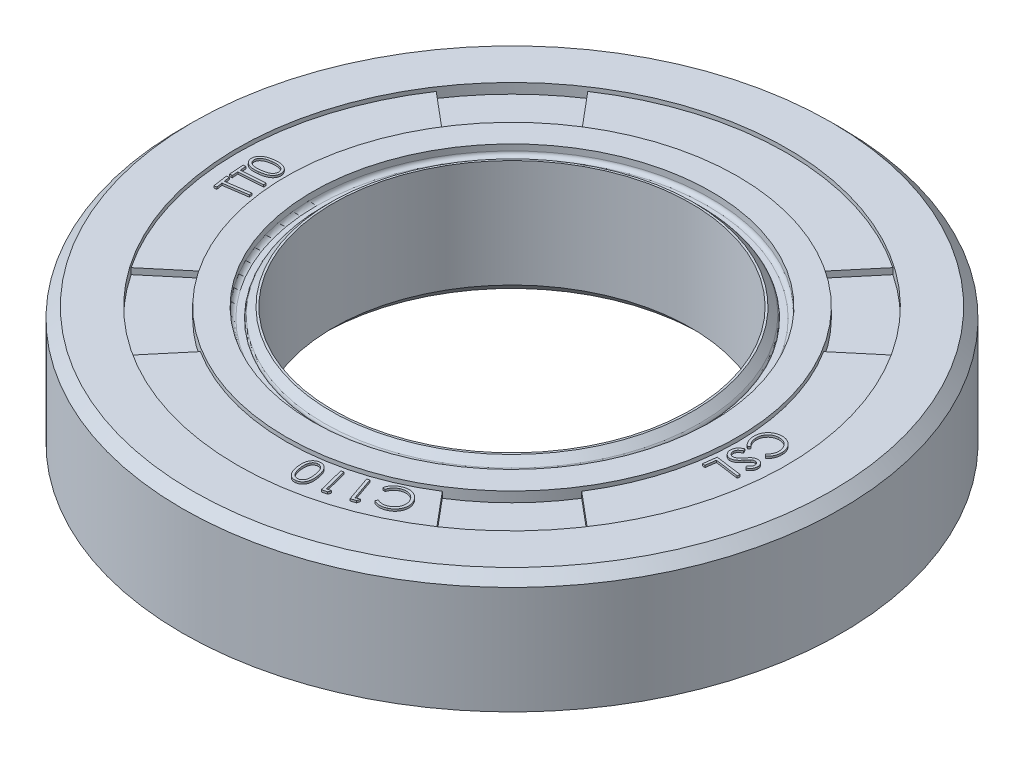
from build123d import *
from build123d.topology import SkipClean

# Parameters (mm, degrees)
SKETCH1_R         = 16.2
EXTRUDE1_DEPTH    = 5.8
SKETCH2_R         = 8.8
EXTRUDE2_DEPTH    = 24.633028
SKETCH3_R         = 15.1
SKETCH3_R_2       = 11.6
EXTRUDE3_DEPTH    = 4.3
EXTRUDE4_DEPTH    = 0.5
CIRPATTERN1_COUNT = 6
SKETCH5_R         = 13.5
SKETCH5_R_2       = 11.1
SKETCH5_R_3       = 9.8
SKETCH5_R_4       = 9.3
EXTRUDE5_DEPTH    = 0.5
CHAMFER1_SIZE     = 0.4
FILLET1_R         = 0.2
CHAMFER2_SIZE     = 0.5
CHAMFER3_SIZE     = 0.5
EXTRUDE6_START    = 0.3
EXTRUDE6_DEPTH    = 0.3
CIRPATTERN2_COUNT = 4
EXTRUDE11_DEPTH   = 0.1


with BuildPart() as part:
    # Sketch1 → Extrude1 (new body)
    with BuildSketch(Plane(origin=(0, 0, 0), x_dir=(1, 0, 0), z_dir=(0, 1, 0))):
        with Locations(Location((0, 0, 0), (0, 0, 270))):
            Circle(SKETCH1_R)
    extrude(amount=EXTRUDE1_DEPTH)

    # Sketch2 → Extrude2 (cut, through all)
    with BuildSketch(Plane(origin=(0, 5.8, 0), x_dir=(1, 0, 0), z_dir=(0, 1, 0))):
        with Locations(Location((0, 0, 0), (0, 0, 270))):
            Circle(SKETCH2_R)
    extrude(amount=-EXTRUDE2_DEPTH, mode=Mode.SUBTRACT)

    # Sketch3 → Extrude3 (cut)
    with BuildSketch(Plane.XZ):
        with Locations(Location((0, 0, 0), (0, 0, 270))):
            Circle(SKETCH3_R)
        with Locations(Location((0, 0, 0), (0, 0, 270))):
            Circle(SKETCH3_R_2, mode=Mode.SUBTRACT)
    extrude(amount=-EXTRUDE3_DEPTH, mode=Mode.SUBTRACT)

    # Sketch4 → Extrude4 (cut)
    with SkipClean():  # the faces are left unmerged after this step: merging them gives an invalid solid
        with BuildSketch(Plane.XZ.offset(-4.3)):
            with BuildLine():
                Line((-4, 14.560563), (-2.172243, 11.394795))
                ThreePointArc((-2.172243, 11.394795), (0, 11.6), (2.172243, 11.394795))
                Line((2.172243, 11.394795), (4, 14.560563))
                ThreePointArc((4, 14.560563), (0, 15.1), (-4, 14.560563))
            make_face()
        extrude4 = extrude(amount=-EXTRUDE4_DEPTH, mode=Mode.SUBTRACT)

    # CirPattern1: Extrude4 ×6 about axis
    with SkipClean():  # the faces are left unmerged after this step: merging them gives an invalid solid
        cirpattern1_axis = Axis((0, 0, 0), (0, 1, 0))
        for i in range(1, CIRPATTERN1_COUNT):
            add(extrude4.rotate(cirpattern1_axis, i * 360 / CIRPATTERN1_COUNT), mode=Mode.SUBTRACT)

    # Sketch5 → Extrude5 (cut)
    # profile 1 of 2: a face of its own
    with SkipClean():  # the faces are left unmerged after this step: merging them gives an invalid solid
        with BuildSketch(Plane(origin=(0, 5.8, 0), x_dir=(1, 0, 0), z_dir=(0, 1, 0))):
            with Locations(Location((0, 0, 0), (0, 0, 270))):
                Circle(SKETCH5_R)
            with Locations(Location((0, 0, 0), (0, 0, 270))):
                Circle(SKETCH5_R_2, mode=Mode.SUBTRACT)
        # profile 2 of 2: a face of its own
        with BuildSketch(Plane(origin=(0, 5.8, 0), x_dir=(1, 0, 0), z_dir=(0, 1, 0))):
            with Locations(Location((0, 0, 0), (0, 0, 270))):
                Circle(SKETCH5_R_3)
            with Locations(Location((0, 0, 0), (0, 0, 270))):
                Circle(SKETCH5_R_4, mode=Mode.SUBTRACT)
        extrude(amount=-EXTRUDE5_DEPTH, mode=Mode.SUBTRACT)

    # Chamfer1
    chamfer1_edges = [part.edges().sort_by_distance(p)[0] for p in [
        (0, 5.8, -9.3),
    ]]
    chamfer(chamfer1_edges, length=CHAMFER1_SIZE)

    # Fillet1
    fillet1_edges = [part.edges().sort_by_distance(p)[0] for p in [
        (0, 5.4, -9.3),
        (0, 5.3, -9.8),
    ]]
    fillet(fillet1_edges, radius=FILLET1_R)

    # Chamfer2
    chamfer2_edges = [part.edges().sort_by_distance(p)[0] for p in [
        (0, 5.8, -16.2),
    ]]
    chamfer(chamfer2_edges, length=CHAMFER2_SIZE)

    # Chamfer3
    chamfer3_edges = [part.edges().sort_by_distance(p)[0] for p in [
        (0, 0, -8.8),
    ]]
    chamfer(chamfer3_edges, length=CHAMFER3_SIZE)

    # Sketch6 → Extrude6 (add)
    with SkipClean():  # the faces are left unmerged after this step: merging them gives an invalid solid
        with BuildSketch(Plane(origin=(0, 5.3, 0), x_dir=(1, 0, 0), z_dir=(0, 1, 0)).offset(EXTRUDE6_START)):
            with BuildLine():
                Line((-7.5, 11.224972), (-5.946064, 9.373064))
                ThreePointArc((-5.946064, 9.373064), (0, 11.1), (5.946064, 9.373064))
                Line((5.946064, 9.373064), (7.5, 11.224972))
                ThreePointArc((7.5, 11.224972), (0, 13.5), (-7.5, 11.224972))
            make_face()
        extrude6 = extrude(amount=-EXTRUDE6_DEPTH)

    # CirPattern2: Extrude6 ×4 about axis
    with SkipClean():  # the faces are left unmerged after this step: merging them gives an invalid solid
        cirpattern2_axis = Axis((0, 0, 0), (0, 1, 0))
        for i in range(1, CIRPATTERN2_COUNT):
            add(extrude6.rotate(cirpattern2_axis, i * 360 / CIRPATTERN2_COUNT))

    # Sketch7 → Extrude11 (add)
    # profile 1 of 10: a face of its own
    with SkipClean():  # the faces are left unmerged after this step: merging them gives an invalid solid
        with BuildSketch(Plane(origin=(0, 5.6, 0), x_dir=(-1, 0, 0), z_dir=(0, 1, 0))):
            with BuildLine():
                Line((-12.492978, 0.035112), (-12.408441, -0.064795))
                add(Edge.make_bspline(
                    [(-12.408441, -0.064795), (-12.417189, -0.072471), (-12.434579, -0.087728), (-12.458825, -0.112145), (-12.481616, -0.137347), (-12.50214, -0.163939), (-12.521254, -0.191257), (-12.538963, -0.219412), (-12.554454, -0.248809), (-12.568315, -0.27905), (-12.580159, -0.310177), (-12.590613, -0.341854), (-12.598805, -0.374376), (-12.605071, -0.407495), (-12.609928, -0.441259), (-12.612883, -0.475675), (-12.61359, -0.510808), (-12.612864, -0.53439), (-12.612496, -0.546314)],
                    knots=[0, 0, 0, 0, 1.02892, 2.045308, 3.041134, 4.031861, 5.013584, 5.98904, 6.971043, 7.949872, 8.929137, 9.91483, 10.898169, 11.892492, 12.894519, 13.913695, 14.945133, 16, 16, 16, 16], degree=3))
                add(Edge.make_bspline(
                    [(-12.612496, -0.546314), (-12.611585, -0.559313), (-12.609776, -0.585126), (-12.604463, -0.623293), (-12.596763, -0.660564), (-12.58661, -0.697018), (-12.574249, -0.73274), (-12.559319, -0.767471), (-12.542246, -0.801373), (-12.523045, -0.834208), (-12.501937, -0.865827), (-12.47875, -0.895282), (-12.454753, -0.923457), (-12.428683, -0.949032), (-12.401169, -0.972864), (-12.372172, -0.99466), (-12.341785, -1.014841), (-12.309764, -1.0324), (-12.276579, -1.048064), (-12.242491, -1.061692), (-12.207244, -1.072467), (-12.171336, -1.081244), (-12.134507, -1.087653), (-12.096882, -1.091561), (-12.058284, -1.093263), (-12.032306, -1.092401), (-12.019145, -1.091964)],
                    knots=[0, 0, 0, 0, 1.043165, 2.07143, 3.082648, 4.08821, 5.099255, 6.106904, 7.112765, 8.136593, 9.150775, 10.153847, 11.136589, 12.111846, 13.074635, 14.049276, 15.014427, 15.99268, 16.970318, 17.951431, 18.929044, 19.918862, 20.909564, 21.919495, 22.945934, 24, 24, 24, 24], degree=3))
                add(Edge.make_bspline(
                    [(-12.019145, -1.091964), (-11.999493, -1.090465), (-11.960932, -1.087523), (-11.90461, -1.077094), (-11.851074, -1.061428), (-11.800273, -1.040586), (-11.751907, -1.015215), (-11.706797, -0.984072), (-11.664008, -0.948508), (-11.624942, -0.907689), (-11.589275, -0.863631), (-11.558607, -0.816484), (-11.533322, -0.766877), (-11.513061, -0.714863), (-11.497879, -0.660363), (-11.488265, -0.603353), (-11.483197, -0.543925), (-11.484318, -0.503566), (-11.48489, -0.482977)],
                    knots=[0, 0, 0, 0, 1.043704, 2.048011, 3.028478, 3.99412, 4.953069, 5.916338, 6.893156, 7.896099, 8.904836, 9.892782, 10.870329, 11.849891, 12.845787, 13.862269, 14.90941, 16, 16, 16, 16], degree=3))
                add(Edge.make_bspline(
                    [(-11.48489, -0.482977), (-11.486562, -0.46038), (-11.489847, -0.415973), (-11.503934, -0.351365), (-11.523661, -0.289784), (-11.550325, -0.231277), (-11.584032, -0.176227), (-11.624163, -0.124166), (-11.670792, -0.075154), (-11.706198, -0.046147), (-11.724192, -0.031404)],
                    knots=[0, 0, 0, 0, 1.028352, 2.020955, 2.995717, 3.961973, 4.934576, 5.921973, 6.943898, 8, 8, 8, 8], degree=3))
                Line((-11.724192, -0.031404), (-11.65052, 0.076454))
                add(Edge.make_bspline(
                    [(-11.65052, 0.076454), (-11.639908, 0.06863), (-11.618751, 0.053031), (-11.588857, 0.027423), (-11.56031, 0.000483), (-11.533993, -0.028571), (-11.508794, -0.058739), (-11.485944, -0.090931), (-11.464252, -0.12442), (-11.444531, -0.159601), (-11.426413, -0.196032), (-11.410841, -0.233932), (-11.397017, -0.272814), (-11.385326, -0.312983), (-11.375822, -0.354311), (-11.368408, -0.396859), (-11.363033, -0.440555), (-11.361241, -0.470155), (-11.360337, -0.485097)],
                    knots=[0, 0, 0, 0, 0.965909, 1.925811, 2.882828, 3.840457, 4.797013, 5.761815, 6.731535, 7.720025, 8.715991, 9.711473, 10.720919, 11.739129, 12.775595, 13.827155, 14.903162, 16, 16, 16, 16], degree=3))
                add(Edge.make_bspline(
                    [(-11.360337, -0.485097), (-11.35973, -0.499317), (-11.358531, -0.527401), (-11.359621, -0.569044), (-11.361711, -0.609664), (-11.366462, -0.649152), (-11.372293, -0.687702), (-11.380746, -0.725033), (-11.390321, -0.76151), (-11.40247, -0.796685), (-11.415806, -0.831076), (-11.431615, -0.864113), (-11.448804, -0.896299), (-11.467875, -0.927459), (-11.489292, -0.957281), (-11.511888, -0.98662), (-11.536921, -1.014374), (-11.55468, -1.031978), (-11.563597, -1.040817)],
                    knots=[0, 0, 0, 0, 1.116828, 2.205582, 3.268238, 4.308028, 5.325951, 6.32692, 7.310839, 8.284344, 9.246125, 10.204501, 11.156839, 12.109353, 13.069307, 14.037415, 15.014544, 16, 16, 16, 16], degree=3))
                add(Edge.make_bspline(
                    [(-11.563597, -1.040817), (-11.579236, -1.055002), (-11.610305, -1.083181), (-11.661343, -1.119694), (-11.714926, -1.151422), (-11.771442, -1.177685), (-11.830584, -1.199035), (-11.892518, -1.215054), (-11.957202, -1.226537), (-12.001432, -1.229557), (-12.023915, -1.231093)],
                    knots=[0, 0, 0, 0, 0.994537, 1.9757, 2.951903, 3.92615, 4.908717, 5.911596, 6.938418, 8, 8, 8, 8], degree=3))
                add(Edge.make_bspline(
                    [(-12.023915, -1.231093), (-12.047597, -1.231637), (-12.094169, -1.232707), (-12.162917, -1.226468), (-12.22903, -1.213675), (-12.292714, -1.194656), (-12.353729, -1.168655), (-12.412265, -1.136472), (-12.468227, -1.09779), (-12.520834, -1.052922), (-12.569214, -1.00319), (-12.612583, -0.949738), (-12.649607, -0.892424), (-12.680387, -0.831531), (-12.705119, -0.767217), (-12.723987, -0.699538), (-12.736833, -0.628268), (-12.740489, -0.5794), (-12.74235, -0.554529)],
                    knots=[0, 0, 0, 0, 1.031303, 2.028055, 3.000099, 3.960627, 4.917641, 5.883826, 6.86585, 7.875936, 8.890971, 9.88439, 10.869584, 11.857412, 12.851463, 13.866353, 14.91406, 16, 16, 16, 16], degree=3))
                add(Edge.make_bspline(
                    [(-12.74235, -0.554529), (-12.742883, -0.539336), (-12.743938, -0.5093), (-12.742366, -0.464638), (-12.739227, -0.420979), (-12.732863, -0.378388), (-12.724839, -0.336748), (-12.714082, -0.296193), (-12.701535, -0.256506), (-12.685967, -0.218137), (-12.668675, -0.180908), (-12.649133, -0.145247), (-12.628079, -0.111063), (-12.604822, -0.078533), (-12.57976, -0.047657), (-12.552748, -0.018302), (-12.524056, 0.009593), (-12.503349, 0.026597), (-12.492978, 0.035112)],
                    knots=[0, 0, 0, 0, 1.096133, 2.166959, 3.221456, 4.251317, 5.2709, 6.278447, 7.275791, 8.270771, 9.262646, 10.234846, 11.201939, 12.156612, 13.116817, 14.068253, 15.032509, 16, 16, 16, 16], degree=3))
            make_face()
        # profile 2 of 10: a face of its own
        with BuildSketch(Plane(origin=(0, 5.6, 0), x_dir=(-1, 0, 0), z_dir=(0, 1, 0))):
            with BuildLine():
                Line((-11.669875, 0.228166), (-11.730562, 0.34371))
                add(Edge.make_bspline(
                    [(-11.730562, 0.34371), (-11.712834, 0.352528), (-11.678971, 0.369371), (-11.632686, 0.39797), (-11.593482, 0.428634), (-11.560508, 0.460322), (-11.534108, 0.493755), (-11.515183, 0.529145), (-11.502279, 0.566024), (-11.499526, 0.591482), (-11.49815, 0.604212)],
                    knots=[0, 0, 0, 0, 1.295561, 2.474722, 3.553828, 4.547373, 5.462176, 6.328771, 7.164335, 8, 8, 8, 8], degree=3))
                add(Edge.make_bspline(
                    [(-11.49815, 0.604212), (-11.497858, 0.615176), (-11.497281, 0.636834), (-11.501538, 0.669066), (-11.509395, 0.70044), (-11.521464, 0.730475), (-11.536223, 0.758703), (-11.55438, 0.783921), (-11.575571, 0.805574), (-11.599183, 0.823828), (-11.624658, 0.838734), (-11.651474, 0.8499), (-11.679406, 0.857312), (-11.698454, 0.859063), (-11.708036, 0.859944)],
                    knots=[0, 0, 0, 0, 1.071265, 2.116041, 3.167901, 4.226727, 5.274107, 6.276407, 7.253901, 8.226803, 9.186963, 10.131962, 11.060228, 12, 12, 12, 12], degree=3))
                add(Edge.make_bspline(
                    [(-11.708036, 0.859944), (-11.719116, 0.860106), (-11.741405, 0.860432), (-11.774762, 0.853008), (-11.808357, 0.841313), (-11.829406, 0.829132), (-11.840275, 0.822843)],
                    knots=[0, 0, 0, 0, 0.950468, 1.912027, 2.921918, 4, 4, 4, 4], degree=3))
                add(Edge.make_bspline(
                    [(-11.840275, 0.822843), (-11.848098, 0.817614), (-11.864575, 0.806603), (-11.88944, 0.787787), (-11.915409, 0.765623), (-11.942679, 0.740383), (-11.971306, 0.712082), (-12.000839, 0.680309), (-12.032261, 0.646049), (-12.052983, 0.621599), (-12.063676, 0.608982)],
                    knots=[0, 0, 0, 0, 0.727589, 1.532321, 2.409631, 3.366842, 4.405402, 5.52175, 6.721105, 8, 8, 8, 8], degree=3))
                add(Edge.make_bspline(
                    [(-12.063676, 0.608982), (-12.074399, 0.596391), (-12.094857, 0.572366), (-12.124923, 0.5388), (-12.152156, 0.508626), (-12.177319, 0.482445), (-12.200071, 0.459859), (-12.22037, 0.440987), (-12.238339, 0.425902), (-12.25001, 0.417839), (-12.255276, 0.414202)],
                    knots=[0, 0, 0, 0, 1.449171, 2.765067, 3.948631, 5.010734, 5.946735, 6.757493, 7.43939, 8, 8, 8, 8], degree=3))
                add(Edge.make_bspline(
                    [(-12.255276, 0.414202), (-12.263321, 0.409026), (-12.279145, 0.398846), (-12.304046, 0.386155), (-12.329142, 0.375423), (-12.354772, 0.367358), (-12.380548, 0.360724), (-12.406837, 0.356942), (-12.433423, 0.354842), (-12.451203, 0.355546), (-12.460127, 0.3559)],
                    knots=[0, 0, 0, 0, 1.058242, 2.081577, 3.089472, 4.07589, 5.052959, 6.032031, 7.012226, 8, 8, 8, 8], degree=3))
                add(Edge.make_bspline(
                    [(-12.460127, 0.3559), (-12.474137, 0.357222), (-12.501663, 0.35982), (-12.541746, 0.369831), (-12.579447, 0.385069), (-12.614928, 0.404861), (-12.646851, 0.429703), (-12.67573, 0.458104), (-12.69974, 0.491223), (-12.720278, 0.527365), (-12.735695, 0.566496), (-12.746446, 0.607301), (-12.751907, 0.649556), (-12.751375, 0.678048), (-12.751105, 0.692459)],
                    knots=[0, 0, 0, 0, 1.020014, 2.004051, 2.984804, 3.963482, 4.941657, 5.911564, 6.892255, 7.899563, 8.920785, 9.934415, 10.955214, 12, 12, 12, 12], degree=3))
                add(Edge.make_bspline(
                    [(-12.751105, 0.692459), (-12.74966, 0.707718), (-12.746797, 0.737971), (-12.735277, 0.782048), (-12.718548, 0.824341), (-12.699591, 0.85779), (-12.681332, 0.883969), (-12.664761, 0.903742), (-12.645977, 0.923884), (-12.624711, 0.944031), (-12.600904, 0.964132), (-12.575057, 0.984815), (-12.546628, 1.005572), (-12.526441, 1.018774), (-12.516044, 1.025573)],
                    knots=[0, 0, 0, 0, 1.29607, 2.569583, 3.841866, 5.137957, 5.81445, 6.542295, 7.320225, 8.145577, 9.020963, 9.957814, 10.948224, 12, 12, 12, 12], degree=3))
                Line((-12.516044, 1.025573), (-12.440781, 0.91374))
                add(Edge.make_bspline(
                    [(-12.440781, 0.91374), (-12.448912, 0.908093), (-12.464632, 0.897175), (-12.487321, 0.88127), (-12.507319, 0.865115), (-12.525749, 0.850281), (-12.541659, 0.835487), (-12.55581, 0.821674), (-12.567503, 0.807975), (-12.58054, 0.790993), (-12.593081, 0.7689), (-12.604747, 0.741394), (-12.612261, 0.71225), (-12.614185, 0.692234), (-12.615156, 0.682124)],
                    knots=[0, 0, 0, 0, 1.179172, 2.279976, 3.298781, 4.24045, 5.096847, 5.885477, 6.594184, 7.240214, 8.433061, 9.607435, 10.791525, 12, 12, 12, 12], degree=3))
                add(Edge.make_bspline(
                    [(-12.615156, 0.682124), (-12.615381, 0.66937), (-12.615817, 0.644685), (-12.608398, 0.609124), (-12.594998, 0.576786), (-12.575374, 0.548523), (-12.550913, 0.525154), (-12.523011, 0.507268), (-12.491605, 0.495636), (-12.469411, 0.493309), (-12.458007, 0.492114)],
                    knots=[0, 0, 0, 0, 1.107661, 2.143815, 3.136475, 4.136969, 5.116041, 6.063306, 7.004841, 8, 8, 8, 8], degree=3))
                add(Edge.make_bspline(
                    [(-12.458007, 0.492114), (-12.450848, 0.491965), (-12.436672, 0.491671), (-12.415415, 0.493858), (-12.39449, 0.498445), (-12.373377, 0.505152), (-12.351686, 0.514816), (-12.329645, 0.5288), (-12.305769, 0.545262), (-12.29056, 0.558718), (-12.282572, 0.565786)],
                    knots=[0, 0, 0, 0, 0.877129, 1.736975, 2.612029, 3.498995, 4.448967, 5.513109, 6.693889, 8, 8, 8, 8], degree=3))
                add(Edge.make_bspline(
                    [(-12.282572, 0.565786), (-12.27991, 0.568424), (-12.273521, 0.574758), (-12.262732, 0.586148), (-12.249164, 0.601036), (-12.233032, 0.619697), (-12.214108, 0.64184), (-12.192213, 0.667318), (-12.167875, 0.69658), (-12.150685, 0.71728), (-12.141588, 0.728235)],
                    knots=[0, 0, 0, 0, 0.418035, 1.00345, 1.749758, 2.664619, 3.754721, 4.998721, 6.411681, 8, 8, 8, 8], degree=3))
                add(Edge.make_bspline(
                    [(-12.141588, 0.728235), (-12.130525, 0.741367), (-12.109063, 0.766841), (-12.076798, 0.802884), (-12.045476, 0.835557), (-12.015263, 0.865005), (-11.986208, 0.891427), (-11.957892, 0.914138), (-11.930782, 0.93369), (-11.896638, 0.954948), (-11.854591, 0.975943), (-11.803672, 0.993043), (-11.753056, 1.003201), (-11.719386, 1.002744), (-11.702736, 1.002518)],
                    knots=[0, 0, 0, 0, 1.150276, 2.231497, 3.240207, 4.181831, 5.057627, 5.870026, 6.612321, 7.295453, 8.563179, 9.749665, 10.887174, 12, 12, 12, 12], degree=3))
                add(Edge.make_bspline(
                    [(-11.702736, 1.002518), (-11.691047, 1.001506), (-11.667855, 0.9995), (-11.633895, 0.992564), (-11.601275, 0.982184), (-11.570186, 0.968236), (-11.540284, 0.95133), (-11.512147, 0.930542), (-11.484916, 0.907056), (-11.459926, 0.880013), (-11.436483, 0.851354), (-11.417, 0.820361), (-11.400403, 0.788404), (-11.386951, 0.755207), (-11.377581, 0.72055), (-11.371093, 0.684749), (-11.368107, 0.647627), (-11.368937, 0.622499), (-11.369357, 0.609777)],
                    knots=[0, 0, 0, 0, 0.98392, 1.952077, 2.901468, 3.850511, 4.806677, 5.777809, 6.78122, 7.81948, 8.86365, 9.883543, 10.884734, 11.882654, 12.882526, 13.891588, 14.932517, 16, 16, 16, 16], degree=3))
                add(Edge.make_bspline(
                    [(-11.369357, 0.609777), (-11.370104, 0.599869), (-11.371577, 0.580328), (-11.376148, 0.551439), (-11.382768, 0.523468), (-11.391285, 0.49616), (-11.401881, 0.469783), (-11.414364, 0.444128), (-11.429066, 0.419521), (-11.445479, 0.395435), (-11.464516, 0.372357), (-11.485788, 0.349619), (-11.509928, 0.327806), (-11.536616, 0.306425), (-11.5661, 0.285873), (-11.59815, 0.265705), (-11.632976, 0.246362), (-11.657367, 0.234334), (-11.669875, 0.228166)],
                    knots=[0, 0, 0, 0, 0.929231, 1.832714, 2.732713, 3.616132, 4.506174, 5.389477, 6.282354, 7.185496, 8.113477, 9.078083, 10.095911, 11.154198, 12.275311, 13.456114, 14.695413, 16, 16, 16, 16], degree=3))
            make_face()
        # profile 3 of 10: a face of its own
        with BuildSketch(Plane(origin=(0, 5.6, 0), x_dir=(-1, 0, 0), z_dir=(0, 1, 0))):
            Polygon((-12.656284, 1.439188), (-12.638529, 1.570102), (-11.460836, 1.410832), (-11.393259, 1.911696), (-11.267381, 1.894736), (-11.352713, 1.262958), align=None)
        # profile 4 of 10: a face of its own
        with BuildSketch(Plane(origin=(0, 5.6, 0), x_dir=(-1, 0, 0), z_dir=(0, 1, 0))):
            with BuildLine():
                Line((-4.7882, 11.532244), (-4.847296, 11.416436))
                add(Edge.make_bspline(
                    [(-4.847296, 11.416436), (-4.868122, 11.426194), (-4.909178, 11.445433), (-4.97361, 11.465642), (-5.039028, 11.477682), (-5.105231, 11.481565), (-5.171665, 11.477867), (-5.237825, 11.46635), (-5.303583, 11.446987), (-5.345785, 11.428314), (-5.367241, 11.418821)],
                    knots=[0, 0, 0, 0, 1.022403, 2.015591, 2.994625, 3.975047, 4.959165, 5.948426, 6.956955, 8, 8, 8, 8], degree=3))
                add(Edge.make_bspline(
                    [(-5.367241, 11.418821), (-5.378809, 11.413059), (-5.401801, 11.401607), (-5.434564, 11.381777), (-5.466088, 11.360753), (-5.495382, 11.3372), (-5.523493, 11.312315), (-5.549551, 11.285175), (-5.574401, 11.256613), (-5.596922, 11.226108), (-5.617984, 11.194831), (-5.636225, 11.16227), (-5.652332, 11.129273), (-5.666447, 11.095679), (-5.67724, 11.061238), (-5.686604, 11.026397), (-5.692712, 10.990716), (-5.697149, 10.954553), (-5.698584, 10.918056), (-5.697914, 10.881573), (-5.694377, 10.845279), (-5.688505, 10.809085), (-5.680337, 10.772924), (-5.669354, 10.736955), (-5.656192, 10.700934), (-5.645399, 10.677525), (-5.639933, 10.66567)],
                    knots=[0, 0, 0, 0, 1.040846, 2.068543, 3.083145, 4.091261, 5.09424, 6.105868, 7.120195, 8.142184, 9.158731, 10.156241, 11.146131, 12.116225, 13.08851, 14.051714, 15.020555, 16.002198, 16.985258, 17.960508, 18.939904, 19.920385, 20.91311, 21.924037, 22.948599, 24, 24, 24, 24], degree=3))
                add(Edge.make_bspline(
                    [(-5.639933, 10.66567), (-5.631086, 10.648165), (-5.613745, 10.613855), (-5.582309, 10.566367), (-5.5475, 10.523182), (-5.509065, 10.48432), (-5.466788, 10.450257), (-5.421272, 10.420308), (-5.371988, 10.395157), (-5.319708, 10.374584), (-5.265564, 10.359095), (-5.210567, 10.348803), (-5.155297, 10.344529), (-5.099743, 10.346348), (-5.043951, 10.353068), (-4.987917, 10.36611), (-4.931614, 10.384528), (-4.895036, 10.401024), (-4.876447, 10.409408)],
                    knots=[0, 0, 0, 0, 1.04447, 2.04717, 3.027883, 3.996501, 4.953694, 5.915932, 6.894893, 7.896653, 8.905346, 9.891411, 10.873422, 11.852949, 12.84903, 13.863058, 14.914, 16, 16, 16, 16], degree=3))
                add(Edge.make_bspline(
                    [(-4.876447, 10.409408), (-4.856406, 10.419659), (-4.816998, 10.439817), (-4.762973, 10.4772), (-4.714007, 10.518847), (-4.670817, 10.565937), (-4.633069, 10.617794), (-4.600871, 10.674545), (-4.573705, 10.736007), (-4.560787, 10.779632), (-4.554198, 10.801884)],
                    knots=[0, 0, 0, 0, 1.0282, 2.021817, 2.995602, 3.961669, 4.935882, 5.921712, 6.939909, 8, 8, 8, 8], degree=3))
                Line((-4.554198, 10.801884), (-4.42726, 10.775648))
                add(Edge.make_bspline(
                    [(-4.42726, 10.775648), (-4.43036, 10.76288), (-4.436527, 10.737485), (-4.448731, 10.700341), (-4.462359, 10.663845), (-4.478601, 10.628407), (-4.496885, 10.593876), (-4.517423, 10.560399), (-4.539909, 10.527786), (-4.564617, 10.496211), (-4.591279, 10.465893), (-4.61978, 10.436795), (-4.650224, 10.409273), (-4.682702, 10.383299), (-4.716853, 10.358587), (-4.753099, 10.335515), (-4.791096, 10.313769), (-4.817545, 10.300708), (-4.830866, 10.294129)],
                    knots=[0, 0, 0, 0, 0.968363, 1.926154, 2.880573, 3.839515, 4.798103, 5.759872, 6.733673, 7.717356, 8.714234, 9.709067, 10.718945, 11.738168, 12.773947, 13.825477, 14.904779, 16, 16, 16, 16], degree=3))
                add(Edge.make_bspline(
                    [(-4.830866, 10.294129), (-4.843709, 10.288176), (-4.869071, 10.27642), (-4.907504, 10.261167), (-4.945562, 10.247743), (-4.983434, 10.236647), (-5.021107, 10.227592), (-5.058525, 10.220688), (-5.09568, 10.215858), (-5.132577, 10.213327), (-5.169207, 10.212289), (-5.205643, 10.214148), (-5.241883, 10.217304), (-5.277738, 10.223424), (-5.313403, 10.230874), (-5.348659, 10.24126), (-5.38392, 10.252885), (-5.406873, 10.262527), (-5.418387, 10.267364)],
                    knots=[0, 0, 0, 0, 1.11775, 2.207212, 3.264022, 4.303748, 5.322359, 6.322578, 7.307276, 8.279465, 9.2424, 10.199047, 11.159071, 12.113273, 13.069716, 14.03467, 15.014165, 16, 16, 16, 16], degree=3))
                add(Edge.make_bspline(
                    [(-5.418387, 10.267364), (-5.437381, 10.276295), (-5.475114, 10.294037), (-5.528306, 10.326618), (-5.577687, 10.363959), (-5.623802, 10.405375), (-5.66608, 10.451469), (-5.704573, 10.502073), (-5.739551, 10.557127), (-5.759422, 10.596412), (-5.769522, 10.616378)],
                    knots=[0, 0, 0, 0, 0.994853, 1.976297, 2.95157, 3.927464, 4.911818, 5.913098, 6.939351, 8, 8, 8, 8], degree=3))
                add(Edge.make_bspline(
                    [(-5.769522, 10.616378), (-5.779178, 10.637839), (-5.798185, 10.680083), (-5.818245, 10.745729), (-5.832479, 10.81112), (-5.838926, 10.876808), (-5.839133, 10.942619), (-5.831782, 11.008605), (-5.817593, 11.074721), (-5.796703, 11.140158), (-5.769969, 11.203847), (-5.736955, 11.263874), (-5.698627, 11.319807), (-5.654951, 11.371673), (-5.605277, 11.418853), (-5.55045, 11.462235), (-5.490085, 11.501521), (-5.446614, 11.52346), (-5.424482, 11.534629)],
                    knots=[0, 0, 0, 0, 1.030349, 2.028217, 3.001568, 3.95878, 4.914959, 5.880681, 6.86241, 7.873682, 8.886753, 9.884673, 10.870386, 11.853784, 12.850413, 13.867322, 14.914243, 16, 16, 16, 16], degree=3))
                add(Edge.make_bspline(
                    [(-5.424482, 11.534629), (-5.410773, 11.540978), (-5.383662, 11.553535), (-5.342156, 11.569293), (-5.300827, 11.58295), (-5.259409, 11.593848), (-5.218055, 11.602004), (-5.176748, 11.607895), (-5.135516, 11.61141), (-5.094359, 11.612123), (-5.053653, 11.610585), (-5.013477, 11.606582), (-4.974079, 11.600287), (-4.935413, 11.591459), (-4.897448, 11.580299), (-4.860155, 11.566844), (-4.823597, 11.550888), (-4.800052, 11.538487), (-4.7882, 11.532244)],
                    knots=[0, 0, 0, 0, 1.0959, 2.167158, 3.219087, 4.252896, 5.2723, 6.275702, 7.279021, 8.272652, 9.260436, 10.233006, 11.200304, 12.15342, 13.108666, 14.069679, 15.028275, 16, 16, 16, 16], degree=3))
            make_face()
        # profile 5 of 10: a face of its own
        with BuildSketch(Plane(origin=(0, 5.6, 0), x_dir=(-1, 0, 0), z_dir=(0, 1, 0))):
            Polygon((-4.337961, 11.970249), (-4.093889, 12.054786), (-3.663517, 10.812167), (-3.786746, 10.769501), (-4.174981, 11.890482), (-4.370027, 11.822905), align=None)
        # profile 6 of 10: a face of its own
        with BuildSketch(Plane(origin=(0, 5.6, 0), x_dir=(-1, 0, 0), z_dir=(0, 1, 0))):
            Polygon((-3.254799, 12.313688), (-3.003572, 12.377024), (-2.682383, 11.097834), (-2.809322, 11.065768), (-3.09924, 12.21961), (-3.300115, 12.169259), align=None)
        # profile 7 of 10: a face of its own
        with BuildSketch(Plane(origin=(0, 5.6, 0), x_dir=(-1, 0, 0), z_dir=(0, 1, 0))):
            with BuildLine():
                add(Edge.make_bspline(
                    [(-2.326726, 11.858114), (-2.329833, 11.879034), (-2.335868, 11.919659), (-2.342933, 11.979019), (-2.347107, 12.035085), (-2.349258, 12.087762), (-2.349542, 12.137118), (-2.346771, 12.18302), (-2.342198, 12.225618), (-2.335015, 12.265101), (-2.325577, 12.301834), (-2.314804, 12.336504), (-2.301995, 12.36911), (-2.287755, 12.400013), (-2.271527, 12.428974), (-2.253573, 12.456094), (-2.233544, 12.481038), (-2.212049, 12.504188), (-2.189148, 12.525232), (-2.165026, 12.544236), (-2.139971, 12.561249), (-2.113565, 12.575823), (-2.086126, 12.588384), (-2.057592, 12.598685), (-2.027868, 12.606705), (-2.007599, 12.610434), (-1.997322, 12.612325)],
                    knots=[0, 0, 0, 0, 1.644773, 3.193903, 4.647558, 6.015721, 7.293474, 8.483905, 9.589981, 10.623468, 11.601493, 12.537908, 13.444935, 14.323926, 15.181999, 16.024139, 16.85024, 17.666832, 18.478758, 19.266254, 20.05315, 20.83115, 21.608907, 22.39772, 23.187609, 24, 24, 24, 24], degree=3))
                add(Edge.make_bspline(
                    [(-1.997322, 12.612325), (-1.986824, 12.613694), (-1.966064, 12.616402), (-1.934876, 12.618117), (-1.904146, 12.616864), (-1.873713, 12.613876), (-1.843701, 12.607888), (-1.814006, 12.599714), (-1.784769, 12.589061), (-1.756085, 12.576004), (-1.727909, 12.560659), (-1.700679, 12.54268), (-1.674595, 12.522037), (-1.649318, 12.499156), (-1.624886, 12.473789), (-1.601941, 12.445443), (-1.579618, 12.415007), (-1.558353, 12.381932), (-1.537941, 12.346031), (-1.519634, 12.306454), (-1.502451, 12.263597), (-1.486108, 12.217564), (-1.472103, 12.16778), (-1.458793, 12.114788), (-1.446788, 12.058326), (-1.440382, 12.019355), (-1.437096, 11.999363)],
                    knots=[0, 0, 0, 0, 0.817622, 1.617046, 2.409067, 3.191268, 3.976826, 4.769817, 5.568512, 6.377777, 7.202289, 8.044486, 8.894935, 9.769356, 10.676679, 11.612424, 12.584199, 13.591153, 14.648301, 15.771647, 16.956421, 18.214596, 19.542769, 20.949513, 22.435047, 24, 24, 24, 24], degree=3))
                add(Edge.make_bspline(
                    [(-1.437096, 11.999363), (-1.434148, 11.979415), (-1.428393, 11.940475), (-1.422008, 11.883298), (-1.417963, 11.828934), (-1.416304, 11.777385), (-1.417036, 11.728651), (-1.420122, 11.682724), (-1.425688, 11.639725), (-1.433344, 11.599444), (-1.443191, 11.561673), (-1.454936, 11.526062), (-1.468124, 11.492272), (-1.483177, 11.460428), (-1.500193, 11.430722), (-1.518809, 11.402941), (-1.539211, 11.377262), (-1.561237, 11.353554), (-1.584873, 11.332202), (-1.609456, 11.312707), (-1.635413, 11.295787), (-1.662096, 11.280541), (-1.690034, 11.267761), (-1.719194, 11.257527), (-1.749225, 11.248836), (-1.769904, 11.245148), (-1.780281, 11.243297)],
                    knots=[0, 0, 0, 0, 1.557864, 3.041164, 4.444055, 5.768762, 7.024753, 8.208337, 9.323258, 10.372686, 11.374214, 12.336823, 13.268371, 14.175086, 15.055501, 15.911123, 16.756392, 17.586985, 18.408329, 19.215254, 20.008408, 20.799947, 21.587916, 22.378041, 23.186177, 24, 24, 24, 24], degree=3))
                add(Edge.make_bspline(
                    [(-1.780281, 11.243297), (-1.790599, 11.241896), (-1.810998, 11.239128), (-1.841675, 11.237861), (-1.871864, 11.239002), (-1.901778, 11.242), (-1.931129, 11.248043), (-1.960286, 11.255861), (-1.988793, 11.26664), (-2.016964, 11.279267), (-2.044405, 11.294437), (-2.070745, 11.312177), (-2.096218, 11.332239), (-2.120427, 11.354802), (-2.143988, 11.379517), (-2.166118, 11.407004), (-2.187659, 11.436582), (-2.207932, 11.468985), (-2.227168, 11.504509), (-2.245091, 11.543741), (-2.261745, 11.586766), (-2.277051, 11.633605), (-2.291306, 11.684279), (-2.304527, 11.738806), (-2.316402, 11.797172), (-2.32322, 11.837422), (-2.326726, 11.858114)],
                    knots=[0, 0, 0, 0, 0.810402, 1.602056, 2.386568, 3.161252, 3.939499, 4.717016, 5.509088, 6.309359, 7.118973, 7.946813, 8.779241, 9.640681, 10.521237, 11.435317, 12.385925, 13.368631, 14.408764, 15.528924, 16.724355, 17.998819, 19.363903, 20.821793, 22.36616, 24, 24, 24, 24], degree=3))
            make_face()
            with BuildLine():
                add(Edge.make_bspline(
                    [(-2.202967, 11.875074), (-2.200064, 11.857213), (-2.194446, 11.822644), (-2.184659, 11.772792), (-2.173984, 11.726611), (-2.163012, 11.683851), (-2.151026, 11.644642), (-2.138748, 11.608819), (-2.125568, 11.576646), (-2.11135, 11.547939), (-2.096312, 11.522026), (-2.080739, 11.498005), (-2.063962, 11.476065), (-2.04659, 11.455725), (-2.027798, 11.437756), (-2.008611, 11.421212), (-1.988274, 11.406784), (-1.960436, 11.390535), (-1.924832, 11.374468), (-1.881263, 11.36224), (-1.837523, 11.357607), (-1.80889, 11.36055), (-1.794591, 11.36202)],
                    knots=[0, 0, 0, 0, 1.481104, 2.866513, 4.157435, 5.360503, 6.478988, 7.512569, 8.459212, 9.322582, 10.13243, 10.91054, 11.66397, 12.391776, 13.097407, 13.789913, 14.464018, 15.134898, 16.426265, 17.648924, 18.825963, 20, 20, 20, 20], degree=3))
                add(Edge.make_bspline(
                    [(-1.794591, 11.36202), (-1.780401, 11.364975), (-1.752043, 11.370881), (-1.711889, 11.388639), (-1.674548, 11.413255), (-1.646177, 11.438954), (-1.625056, 11.462551), (-1.610926, 11.482566), (-1.597737, 11.503899), (-1.586191, 11.526886), (-1.576027, 11.55152), (-1.567447, 11.577688), (-1.559793, 11.605407), (-1.556289, 11.624609), (-1.554494, 11.634447)],
                    knots=[0, 0, 0, 0, 1.338807, 2.67569, 4.034331, 5.464598, 6.206209, 6.961977, 7.729163, 8.526442, 9.340448, 10.193839, 11.074611, 12, 12, 12, 12], degree=3))
                add(Edge.make_bspline(
                    [(-1.554494, 11.634447), (-1.55241, 11.646883), (-1.548154, 11.672282), (-1.544344, 11.711408), (-1.542328, 11.751995), (-1.541629, 11.794084), (-1.543457, 11.83766), (-1.546565, 11.882834), (-1.551592, 11.929513), (-1.556324, 11.96104), (-1.558734, 11.977102)],
                    knots=[0, 0, 0, 0, 0.878807, 1.794885, 2.738371, 3.711439, 4.728208, 5.777701, 6.867835, 8, 8, 8, 8], degree=3))
                add(Edge.make_bspline(
                    [(-1.558734, 11.977102), (-1.561341, 11.993115), (-1.566443, 12.024451), (-1.576119, 12.069912), (-1.586465, 12.112943), (-1.597401, 12.153631), (-1.609997, 12.19173), (-1.623139, 12.227614), (-1.637364, 12.261018), (-1.652817, 12.291823), (-1.668996, 12.320317), (-1.686, 12.34652), (-1.70338, 12.370762), (-1.721695, 12.39258), (-1.740785, 12.411947), (-1.760529, 12.429074), (-1.780988, 12.44401), (-1.808726, 12.460558), (-1.844019, 12.476625), (-1.887139, 12.488907), (-1.93054, 12.493503), (-1.958996, 12.490564), (-1.973206, 12.489096)],
                    knots=[0, 0, 0, 0, 1.329012, 2.600788, 3.806715, 4.954973, 6.05124, 7.093124, 8.085231, 9.023841, 9.915225, 10.768389, 11.581957, 12.357557, 13.099611, 13.807676, 14.496735, 15.171933, 16.451306, 17.661157, 18.83209, 20, 20, 20, 20], degree=3))
                add(Edge.make_bspline(
                    [(-1.973206, 12.489096), (-1.987405, 12.486164), (-2.015818, 12.480296), (-2.056078, 12.462068), (-2.093769, 12.437147), (-2.122367, 12.410867), (-2.143725, 12.387011), (-2.158189, 12.366969), (-2.171632, 12.345761), (-2.183217, 12.322665), (-2.193853, 12.29822), (-2.202748, 12.272113), (-2.210585, 12.244651), (-2.216661, 12.215246), (-2.22113, 12.183472), (-2.224057, 12.148795), (-2.224999, 12.111021), (-2.224157, 12.069995), (-2.221363, 12.025814), (-2.217156, 11.978348), (-2.211043, 11.927708), (-2.205716, 11.892992), (-2.202967, 11.875074)],
                    knots=[0, 0, 0, 0, 1.183655, 2.368502, 3.589717, 4.869294, 5.535165, 6.207599, 6.889681, 7.588121, 8.320072, 9.070049, 9.843698, 10.656203, 11.525314, 12.46858, 13.502882, 14.616521, 15.826103, 17.125442, 18.516359, 20, 20, 20, 20], degree=3))
            make_face(mode=Mode.SUBTRACT)
        # profile 8 of 10: a face of its own
        with BuildSketch(Plane(origin=(0, 5.6, 0), x_dir=(-1, 0, 0), z_dir=(0, 1, 0))):
            Polygon((12.447486, 2.057974), (12.574159, 2.07679), (12.679897, 1.361535), (12.553224, 1.342719), (12.510293, 1.633433), (11.333395, 1.459588), (11.313784, 1.592621), (12.490682, 1.766466), align=None)
        # profile 9 of 10: a face of its own
        with BuildSketch(Plane(origin=(0, 5.6, 0), x_dir=(-1, 0, 0), z_dir=(0, 1, 0))):
            Polygon((12.560062, 1.191591), (12.688061, 1.200071), (12.736027, 0.478191), (12.608028, 0.469711), (12.588683, 0.763074), (11.40092, 0.684102), (11.39191, 0.818195), (12.579673, 0.897168), align=None)
        # profile 10 of 10: a face of its own
        with BuildSketch(Plane(origin=(0, 5.6, 0), x_dir=(-1, 0, 0), z_dir=(0, 1, 0))):
            with BuildLine():
                add(Edge.make_bspline(
                    [(12.080142, 0.384882), (12.101068, 0.38719), (12.141725, 0.391675), (12.201005, 0.396551), (12.256878, 0.39907), (12.3093, 0.398931), (12.358396, 0.397359), (12.403955, 0.393103), (12.446098, 0.386834), (12.485017, 0.378284), (12.521309, 0.36793), (12.555281, 0.355731), (12.587265, 0.341811), (12.617538, 0.32663), (12.645641, 0.309313), (12.671842, 0.290434), (12.695948, 0.269685), (12.718221, 0.247481), (12.738348, 0.22385), (12.756387, 0.19926), (12.772214, 0.173582), (12.785624, 0.146836), (12.797144, 0.11914), (12.806367, 0.090414), (12.813729, 0.060687), (12.816516, 0.040318), (12.817923, 0.030037)],
                    knots=[0, 0, 0, 0, 1.64577, 3.197669, 4.649231, 6.016591, 7.295089, 8.488025, 9.591667, 10.623857, 11.600908, 12.540207, 13.443371, 14.326673, 15.185363, 16.021087, 16.848782, 17.669156, 18.477378, 19.272992, 20.051151, 20.832521, 21.609699, 22.393719, 23.189333, 24, 24, 24, 24], degree=3))
                add(Edge.make_bspline(
                    [(12.817923, 0.030037), (12.818975, 0.019536), (12.821049, -0.001167), (12.821207, -0.032278), (12.819156, -0.062848), (12.814598, -0.093066), (12.807685, -0.122632), (12.798621, -0.151917), (12.786994, -0.180629), (12.772887, -0.208795), (12.756476, -0.236134), (12.737479, -0.262443), (12.716369, -0.287905), (12.692584, -0.312151), (12.666277, -0.335154), (12.637581, -0.35717), (12.606441, -0.378159), (12.572709, -0.398119), (12.535959, -0.416668), (12.4961, -0.433964), (12.452869, -0.449494), (12.406301, -0.463467), (12.356462, -0.476243), (12.303179, -0.487155), (12.246653, -0.497144), (12.207723, -0.502168), (12.187735, -0.504748)],
                    knots=[0, 0, 0, 0, 0.818818, 1.614219, 2.41148, 3.195001, 3.983367, 4.766258, 5.572228, 6.384821, 7.209132, 8.044463, 8.901298, 9.774061, 10.677736, 11.611677, 12.579655, 13.590959, 14.651948, 15.772859, 16.961455, 18.215192, 19.545595, 20.953548, 22.435886, 24, 24, 24, 24], degree=3))
                add(Edge.make_bspline(
                    [(12.187735, -0.504748), (12.167786, -0.507025), (12.12892, -0.511461), (12.071799, -0.515337), (12.017618, -0.51725), (11.96633, -0.517138), (11.91804, -0.51448), (11.872579, -0.509724), (11.829941, -0.503082), (11.79019, -0.493587), (11.752898, -0.482537), (11.717965, -0.46941), (11.684886, -0.455247), (11.653989, -0.438984), (11.625224, -0.420943), (11.598175, -0.401643), (11.57352, -0.380268), (11.55074, -0.357526), (11.529959, -0.333435), (11.511829, -0.308023), (11.495697, -0.281726), (11.481693, -0.254576), (11.469841, -0.226258), (11.460804, -0.196907), (11.453372, -0.166668), (11.450401, -0.146048), (11.448895, -0.135592)],
                    knots=[0, 0, 0, 0, 1.559489, 3.038364, 4.445855, 5.770202, 7.020936, 8.200788, 9.319852, 10.37009, 11.373042, 12.339194, 13.267239, 14.166555, 15.048105, 15.903219, 16.744988, 17.579537, 18.401953, 19.213186, 20.001668, 20.796513, 21.584039, 22.382666, 23.179877, 24, 24, 24, 24], degree=3))
                add(Edge.make_bspline(
                    [(11.448895, -0.135592), (11.447843, -0.125268), (11.445762, -0.104832), (11.445604, -0.074249), (11.447662, -0.044204), (11.452263, -0.014724), (11.458876, 0.014357), (11.467834, 0.042928), (11.479411, 0.07096), (11.493132, 0.098469), (11.509214, 0.125243), (11.527953, 0.150698), (11.548761, 0.17531), (11.571928, 0.198755), (11.597735, 0.220934), (11.62577, 0.241991), (11.656019, 0.262245), (11.688954, 0.281177), (11.724901, 0.299039), (11.764457, 0.315465), (11.807926, 0.330155), (11.855032, 0.343938), (11.905985, 0.356292), (11.960594, 0.367458), (12.019069, 0.376881), (12.059369, 0.38216), (12.080142, 0.384882)],
                    knots=[0, 0, 0, 0, 0.811703, 1.606662, 2.389721, 3.165947, 3.938965, 4.721628, 5.505937, 6.309683, 7.125291, 7.946562, 8.780305, 9.645464, 10.522689, 11.440663, 12.387741, 13.369452, 14.411235, 15.526795, 16.718161, 18.000002, 19.366374, 20.819629, 22.360588, 24, 24, 24, 24], degree=3))
            make_face()
            with BuildLine():
                add(Edge.make_bspline(
                    [(12.092598, 0.261389), (12.07474, 0.2591), (12.040201, 0.254673), (11.990279, 0.246676), (11.943866, 0.238006), (11.900914, 0.22846), (11.861383, 0.218359), (11.82559, 0.206778), (11.79304, 0.195107), (11.763935, 0.181919), (11.737516, 0.16805), (11.713074, 0.153419), (11.690805, 0.137567), (11.670009, 0.12103), (11.65133, 0.103287), (11.634204, 0.084699), (11.619035, 0.065015), (11.601751, 0.037952), (11.584683, 0.003097), (11.570771, -0.039585), (11.564528, -0.082888), (11.56641, -0.111471), (11.567353, -0.125787)],
                    knots=[0, 0, 0, 0, 1.481265, 2.865004, 4.159383, 5.365579, 6.485047, 7.514848, 8.459985, 9.328607, 10.141396, 10.914238, 11.670461, 12.388999, 13.098548, 13.787932, 14.466852, 15.140264, 16.427502, 17.648087, 18.821966, 20, 20, 20, 20], degree=3))
                add(Edge.make_bspline(
                    [(11.567353, -0.125787), (11.569724, -0.140067), (11.574439, -0.16847), (11.591333, -0.208783), (11.613825, -0.247123), (11.638624, -0.276262), (11.661527, -0.297769), (11.680488, -0.313044), (11.701176, -0.326918), (11.723846, -0.338835), (11.747715, -0.350293), (11.773585, -0.359525), (11.800801, -0.36827), (11.819776, -0.372482), (11.829445, -0.374629)],
                    knots=[0, 0, 0, 0, 1.342888, 2.670876, 4.03832, 5.46759, 6.211946, 6.960376, 7.730958, 8.525415, 9.34181, 10.192296, 11.078879, 12, 12, 12, 12], degree=3))
                add(Edge.make_bspline(
                    [(11.829445, -0.374629), (11.841787, -0.377162), (11.866883, -0.382314), (11.905678, -0.38737), (11.945978, -0.39118), (11.987901, -0.392979), (12.031308, -0.392897), (12.076291, -0.391245), (12.122892, -0.388197), (12.154444, -0.38465), (12.17051, -0.382844)],
                    knots=[0, 0, 0, 0, 0.881997, 1.793585, 2.737835, 3.716179, 4.730681, 5.776771, 6.868032, 8, 8, 8, 8], degree=3))
                add(Edge.make_bspline(
                    [(12.17051, -0.382844), (12.186508, -0.380705), (12.217764, -0.376525), (12.263423, -0.369241), (12.306623, -0.36044), (12.347472, -0.350678), (12.385874, -0.3399), (12.421846, -0.3279), (12.455485, -0.314987), (12.486859, -0.301015), (12.515692, -0.285728), (12.542663, -0.270307), (12.567063, -0.253464), (12.58932, -0.236072), (12.609366, -0.217943), (12.627287, -0.19907), (12.642885, -0.179272), (12.66032, -0.15228), (12.677468, -0.117722), (12.690852, -0.075092), (12.697681, -0.032143), (12.69551, -0.003718), (12.694429, 0.010427)],
                    knots=[0, 0, 0, 0, 1.329259, 2.597014, 3.806881, 4.959098, 6.055318, 7.090555, 8.080851, 9.021904, 9.916747, 10.767693, 11.57887, 12.356026, 13.092518, 13.802706, 14.496917, 15.164823, 16.446693, 17.659248, 18.835197, 20, 20, 20, 20], degree=3))
                add(Edge.make_bspline(
                    [(12.694429, 0.010427), (12.692042, 0.0247), (12.68728, 0.05317), (12.670557, 0.093696), (12.64756, 0.132215), (12.622362, 0.16141), (12.599525, 0.183665), (12.579938, 0.19857), (12.55928, 0.212764), (12.536927, 0.22559), (12.512785, 0.236558), (12.487175, 0.246355), (12.460181, 0.255224), (12.431194, 0.262311), (12.399924, 0.268334), (12.365543, 0.272098), (12.327959, 0.274447), (12.287113, 0.275146), (12.243087, 0.274392), (12.195817, 0.27156), (12.145267, 0.267378), (12.11052, 0.263427), (12.092598, 0.261389)],
                    knots=[0, 0, 0, 0, 1.187541, 2.368658, 3.581645, 4.866062, 5.529309, 6.202557, 6.888056, 7.591324, 8.319871, 9.067744, 9.847035, 10.656263, 11.521656, 12.465692, 13.49998, 14.619639, 15.826512, 17.122458, 18.515726, 20, 20, 20, 20], degree=3))
            make_face(mode=Mode.SUBTRACT)
        extrude(amount=EXTRUDE11_DEPTH)


solid = part.part
